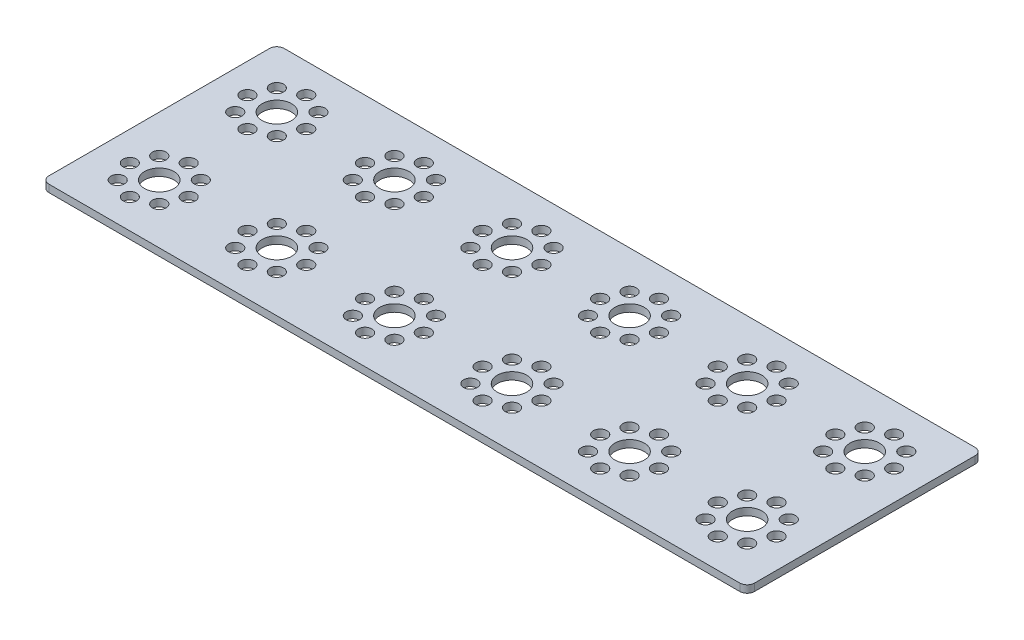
from build123d import *

# Parameters (mm, degrees)
SKETCH1_W          = 192
SKETCH1_H          = 64
EXTRUDE1_DEPTH     = 2
SKETCH2_R          = 4
SKETCH2_R_2        = 1.85
CUT_EXTRUDE1_DEPTH = 203.395652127
FILLET1_R          = 2
FILLET2_R          = 2
FILLET3_R          = 2
FILLET4_R          = 2


with BuildPart() as part:
    # Sketch1 → Extrude1 (new body)
    with BuildSketch(Plane(origin=(0, 0, 0), x_dir=(1, 0, 0), z_dir=(0, 1, 0))):
        with Locations((96, 32)):
            Rectangle(SKETCH1_W, SKETCH1_H)
    extrude(amount=EXTRUDE1_DEPTH)

    # Sketch2 → Cut-Extrude1 (cut, through all)
    with BuildSketch(Plane(origin=(0, 2, 0), x_dir=(1, 0, 0), z_dir=(0, 1, 0))):
        with Locations(Location((80, 48, 0), (0, 0, 270))):
            Circle(SKETCH2_R)
        with Locations(Location((80, 40, 0), (0, 0, 270))):
            Circle(SKETCH2_R_2)
        with Locations(Location((80, 56, 0), (0, 0, 270))):
            Circle(SKETCH2_R_2)
        with Locations(Location((72, 48, 0), (0, 0, 270))):
            Circle(SKETCH2_R_2)
        with Locations(Location((88, 48, 0), (0, 0, 270))):
            Circle(SKETCH2_R_2)
        with Locations(Location((85.66, 53.66, 0), (0, 0, 270))):
            Circle(SKETCH2_R_2)
        with Locations(Location((74.34, 53.66, 0), (0, 0, 270))):
            Circle(SKETCH2_R_2)
        with Locations(Location((85.66, 42.34, 0), (0, 0, 270))):
            Circle(SKETCH2_R_2)
        with Locations(Location((74.34, 42.34, 0), (0, 0, 270))):
            Circle(SKETCH2_R_2)
        with Locations(Location((48, 48, 0), (0, 0, 270))):
            Circle(SKETCH2_R)
        with Locations(Location((48, 40, 0), (0, 0, 270))):
            Circle(SKETCH2_R_2)
        with Locations(Location((48, 56, 0), (0, 0, 270))):
            Circle(SKETCH2_R_2)
        with Locations(Location((40, 48, 0), (0, 0, 270))):
            Circle(SKETCH2_R_2)
        with Locations(Location((56, 48, 0), (0, 0, 270))):
            Circle(SKETCH2_R_2)
        with Locations(Location((53.66, 53.66, 0), (0, 0, 270))):
            Circle(SKETCH2_R_2)
        with Locations(Location((42.34, 53.66, 0), (0, 0, 270))):
            Circle(SKETCH2_R_2)
        with Locations(Location((53.66, 42.34, 0), (0, 0, 270))):
            Circle(SKETCH2_R_2)
        with Locations(Location((42.34, 42.34, 0), (0, 0, 270))):
            Circle(SKETCH2_R_2)
        with Locations(Location((16, 48, 0), (0, 0, 270))):
            Circle(SKETCH2_R)
        with Locations(Location((16, 40, 0), (0, 0, 270))):
            Circle(SKETCH2_R_2)
        with Locations(Location((16, 56, 0), (0, 0, 270))):
            Circle(SKETCH2_R_2)
        with Locations(Location((8, 48, 0), (0, 0, 270))):
            Circle(SKETCH2_R_2)
        with Locations(Location((24, 48, 0), (0, 0, 270))):
            Circle(SKETCH2_R_2)
        with Locations(Location((21.66, 53.66, 0), (0, 0, 270))):
            Circle(SKETCH2_R_2)
        with Locations(Location((10.34, 53.66, 0), (0, 0, 270))):
            Circle(SKETCH2_R_2)
        with Locations(Location((21.66, 42.34, 0), (0, 0, 270))):
            Circle(SKETCH2_R_2)
        with Locations(Location((10.34, 42.34, 0), (0, 0, 270))):
            Circle(SKETCH2_R_2)
        with Locations(Location((112, 48, 0), (0, 0, 270))):
            Circle(SKETCH2_R)
        with Locations(Location((112, 40, 0), (0, 0, 270))):
            Circle(SKETCH2_R_2)
        with Locations(Location((112, 56, 0), (0, 0, 270))):
            Circle(SKETCH2_R_2)
        with Locations(Location((104, 48, 0), (0, 0, 270))):
            Circle(SKETCH2_R_2)
        with Locations(Location((120, 48, 0), (0, 0, 270))):
            Circle(SKETCH2_R_2)
        with Locations(Location((117.66, 53.66, 0), (0, 0, 270))):
            Circle(SKETCH2_R_2)
        with Locations(Location((106.34, 53.66, 0), (0, 0, 270))):
            Circle(SKETCH2_R_2)
        with Locations(Location((117.66, 42.34, 0), (0, 0, 270))):
            Circle(SKETCH2_R_2)
        with Locations(Location((106.34, 42.34, 0), (0, 0, 270))):
            Circle(SKETCH2_R_2)
        with Locations(Location((144, 48, 0), (0, 0, 270))):
            Circle(SKETCH2_R)
        with Locations(Location((144, 40, 0), (0, 0, 270))):
            Circle(SKETCH2_R_2)
        with Locations(Location((144, 56, 0), (0, 0, 270))):
            Circle(SKETCH2_R_2)
        with Locations(Location((136, 48, 0), (0, 0, 270))):
            Circle(SKETCH2_R_2)
        with Locations(Location((152, 48, 0), (0, 0, 270))):
            Circle(SKETCH2_R_2)
        with Locations(Location((149.66, 53.66, 0), (0, 0, 270))):
            Circle(SKETCH2_R_2)
        with Locations(Location((138.34, 53.66, 0), (0, 0, 270))):
            Circle(SKETCH2_R_2)
        with Locations(Location((149.66, 42.34, 0), (0, 0, 270))):
            Circle(SKETCH2_R_2)
        with Locations(Location((138.34, 42.34, 0), (0, 0, 270))):
            Circle(SKETCH2_R_2)
        with Locations(Location((176, 48, 0), (0, 0, 270))):
            Circle(SKETCH2_R)
        with Locations(Location((176, 40, 0), (0, 0, 270))):
            Circle(SKETCH2_R_2)
        with Locations(Location((176, 56, 0), (0, 0, 270))):
            Circle(SKETCH2_R_2)
        with Locations(Location((168, 48, 0), (0, 0, 270))):
            Circle(SKETCH2_R_2)
        with Locations(Location((184, 48, 0), (0, 0, 270))):
            Circle(SKETCH2_R_2)
        with Locations(Location((181.66, 53.66, 0), (0, 0, 270))):
            Circle(SKETCH2_R_2)
        with Locations(Location((170.34, 53.66, 0), (0, 0, 270))):
            Circle(SKETCH2_R_2)
        with Locations(Location((181.66, 42.34, 0), (0, 0, 270))):
            Circle(SKETCH2_R_2)
        with Locations(Location((170.34, 42.34, 0), (0, 0, 270))):
            Circle(SKETCH2_R_2)
        with Locations(Location((176, 16, 0), (0, 0, 270))):
            Circle(SKETCH2_R)
        with Locations(Location((176, 8, 0), (0, 0, 270))):
            Circle(SKETCH2_R_2)
        with Locations(Location((176, 24, 0), (0, 0, 270))):
            Circle(SKETCH2_R_2)
        with Locations(Location((168, 16, 0), (0, 0, 270))):
            Circle(SKETCH2_R_2)
        with Locations(Location((184, 16, 0), (0, 0, 270))):
            Circle(SKETCH2_R_2)
        with Locations(Location((181.66, 21.66, 0), (0, 0, 270))):
            Circle(SKETCH2_R_2)
        with Locations(Location((170.34, 21.66, 0), (0, 0, 270))):
            Circle(SKETCH2_R_2)
        with Locations(Location((181.66, 10.34, 0), (0, 0, 270))):
            Circle(SKETCH2_R_2)
        with Locations(Location((170.34, 10.34, 0), (0, 0, 270))):
            Circle(SKETCH2_R_2)
        with Locations(Location((144, 16, 0), (0, 0, 270))):
            Circle(SKETCH2_R)
        with Locations(Location((144, 8, 0), (0, 0, 270))):
            Circle(SKETCH2_R_2)
        with Locations(Location((144, 24, 0), (0, 0, 270))):
            Circle(SKETCH2_R_2)
        with Locations(Location((136, 16, 0), (0, 0, 270))):
            Circle(SKETCH2_R_2)
        with Locations(Location((152, 16, 0), (0, 0, 270))):
            Circle(SKETCH2_R_2)
        with Locations(Location((149.66, 21.66, 0), (0, 0, 270))):
            Circle(SKETCH2_R_2)
        with Locations(Location((138.34, 21.66, 0), (0, 0, 270))):
            Circle(SKETCH2_R_2)
        with Locations(Location((149.66, 10.34, 0), (0, 0, 270))):
            Circle(SKETCH2_R_2)
        with Locations(Location((138.34, 10.34, 0), (0, 0, 270))):
            Circle(SKETCH2_R_2)
        with Locations(Location((112, 16, 0), (0, 0, 270))):
            Circle(SKETCH2_R)
        with Locations(Location((112, 8, 0), (0, 0, 270))):
            Circle(SKETCH2_R_2)
        with Locations(Location((112, 24, 0), (0, 0, 270))):
            Circle(SKETCH2_R_2)
        with Locations(Location((104, 16, 0), (0, 0, 270))):
            Circle(SKETCH2_R_2)
        with Locations(Location((120, 16, 0), (0, 0, 270))):
            Circle(SKETCH2_R_2)
        with Locations(Location((117.66, 21.66, 0), (0, 0, 270))):
            Circle(SKETCH2_R_2)
        with Locations(Location((106.34, 21.66, 0), (0, 0, 270))):
            Circle(SKETCH2_R_2)
        with Locations(Location((117.66, 10.34, 0), (0, 0, 270))):
            Circle(SKETCH2_R_2)
        with Locations(Location((106.34, 10.34, 0), (0, 0, 270))):
            Circle(SKETCH2_R_2)
        with Locations(Location((80, 16, 0), (0, 0, 270))):
            Circle(SKETCH2_R)
        with Locations(Location((80, 8, 0), (0, 0, 270))):
            Circle(SKETCH2_R_2)
        with Locations(Location((80, 24, 0), (0, 0, 270))):
            Circle(SKETCH2_R_2)
        with Locations(Location((72, 16, 0), (0, 0, 270))):
            Circle(SKETCH2_R_2)
        with Locations(Location((88, 16, 0), (0, 0, 270))):
            Circle(SKETCH2_R_2)
        with Locations(Location((85.66, 21.66, 0), (0, 0, 270))):
            Circle(SKETCH2_R_2)
        with Locations(Location((74.34, 21.66, 0), (0, 0, 270))):
            Circle(SKETCH2_R_2)
        with Locations(Location((85.66, 10.34, 0), (0, 0, 270))):
            Circle(SKETCH2_R_2)
        with Locations(Location((74.34, 10.34, 0), (0, 0, 270))):
            Circle(SKETCH2_R_2)
        with Locations(Location((48, 16, 0), (0, 0, 270))):
            Circle(SKETCH2_R)
        with Locations(Location((48, 8, 0), (0, 0, 270))):
            Circle(SKETCH2_R_2)
        with Locations(Location((48, 24, 0), (0, 0, 270))):
            Circle(SKETCH2_R_2)
        with Locations(Location((40, 16, 0), (0, 0, 270))):
            Circle(SKETCH2_R_2)
        with Locations(Location((56, 16, 0), (0, 0, 270))):
            Circle(SKETCH2_R_2)
        with Locations(Location((53.66, 21.66, 0), (0, 0, 270))):
            Circle(SKETCH2_R_2)
        with Locations(Location((42.34, 21.66, 0), (0, 0, 270))):
            Circle(SKETCH2_R_2)
        with Locations(Location((53.66, 10.34, 0), (0, 0, 270))):
            Circle(SKETCH2_R_2)
        with Locations(Location((42.34, 10.34, 0), (0, 0, 270))):
            Circle(SKETCH2_R_2)
        with Locations(Location((16, 16, 0), (0, 0, 270))):
            Circle(SKETCH2_R)
        with Locations(Location((16, 8, 0), (0, 0, 270))):
            Circle(SKETCH2_R_2)
        with Locations(Location((16, 24, 0), (0, 0, 270))):
            Circle(SKETCH2_R_2)
        with Locations(Location((8, 16, 0), (0, 0, 270))):
            Circle(SKETCH2_R_2)
        with Locations(Location((24, 16, 0), (0, 0, 270))):
            Circle(SKETCH2_R_2)
        with Locations(Location((21.66, 21.66, 0), (0, 0, 270))):
            Circle(SKETCH2_R_2)
        with Locations(Location((10.34, 21.66, 0), (0, 0, 270))):
            Circle(SKETCH2_R_2)
        with Locations(Location((21.66, 10.34, 0), (0, 0, 270))):
            Circle(SKETCH2_R_2)
        with Locations(Location((10.34, 10.34, 0), (0, 0, 270))):
            Circle(SKETCH2_R_2)
    extrude(amount=-CUT_EXTRUDE1_DEPTH, mode=Mode.SUBTRACT)

    # Fillet1
    fillet1_edges = [part.edges().sort_by_distance(p)[0] for p in [
        (0, 1, 0),
    ]]
    fillet(fillet1_edges, radius=FILLET1_R)

    # Fillet2
    fillet2_edges = [part.edges().sort_by_distance(p)[0] for p in [
        (0, 1, -64),
    ]]
    fillet(fillet2_edges, radius=FILLET2_R)

    # Fillet3
    fillet3_edges = [part.edges().sort_by_distance(p)[0] for p in [
        (192, 1, 0),
    ]]
    fillet(fillet3_edges, radius=FILLET3_R)

    # Fillet4
    fillet4_edges = [part.edges().sort_by_distance(p)[0] for p in [
        (192, 1, -64),
    ]]
    fillet(fillet4_edges, radius=FILLET4_R)


solid = part.part
